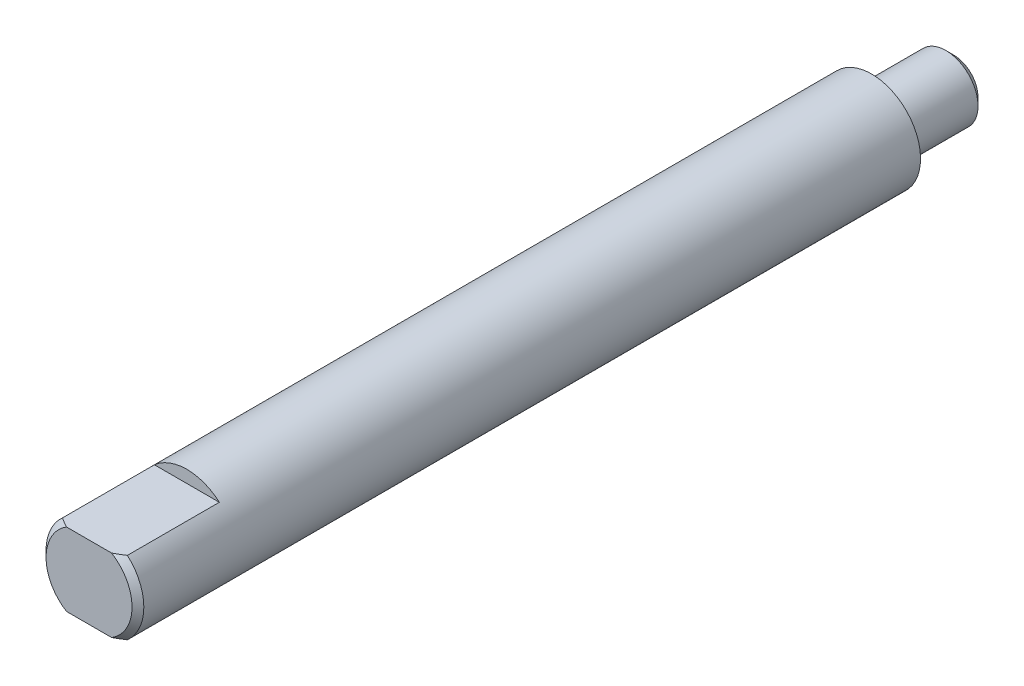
from build123d import *

# Parameters (mm, degrees)
SKETCH2_W          = 6.35
SKETCH2_H          = 0.8
CUT_EXTRUDE1_DEPTH = 5


with BuildPart() as part:
    # Sketch1 → Revolve1 (revolve)
    with BuildSketch(Plane(origin=(0, 0, 0), x_dir=(0, 0, -1), z_dir=(1, 0, 0)), mode=Mode.PRIVATE) as revolve1_sk:
        Polygon((52.07, 1.57), (51.56, 2.0828), (46.736, 2.0828), (46.736, 3.175), (-3.684, 3.175), (-4.064, 2.79), (-4.064, 0), (52.07, 0), align=None)
    revolve(revolve1_sk.sketch.rotate(Axis((0, 0, 4.064), (0, 0, -1)), 180), axis=Axis((0, 0, 4.064), (0, 0, -1)))

    # Sketch2 → Cut-Extrude1 (cut, symmetric)
    with BuildSketch(Plane(origin=(0, 0, 0), x_dir=(0, 0, -1), z_dir=(1, 0, 0))):
        with Locations((-0.889, 2.775)):
            Rectangle(SKETCH2_W, SKETCH2_H)
        with Locations((-0.889, -2.775)):
            Rectangle(SKETCH2_W, SKETCH2_H)
    extrude(amount=CUT_EXTRUDE1_DEPTH, both=True, mode=Mode.SUBTRACT)


solid = part.part
